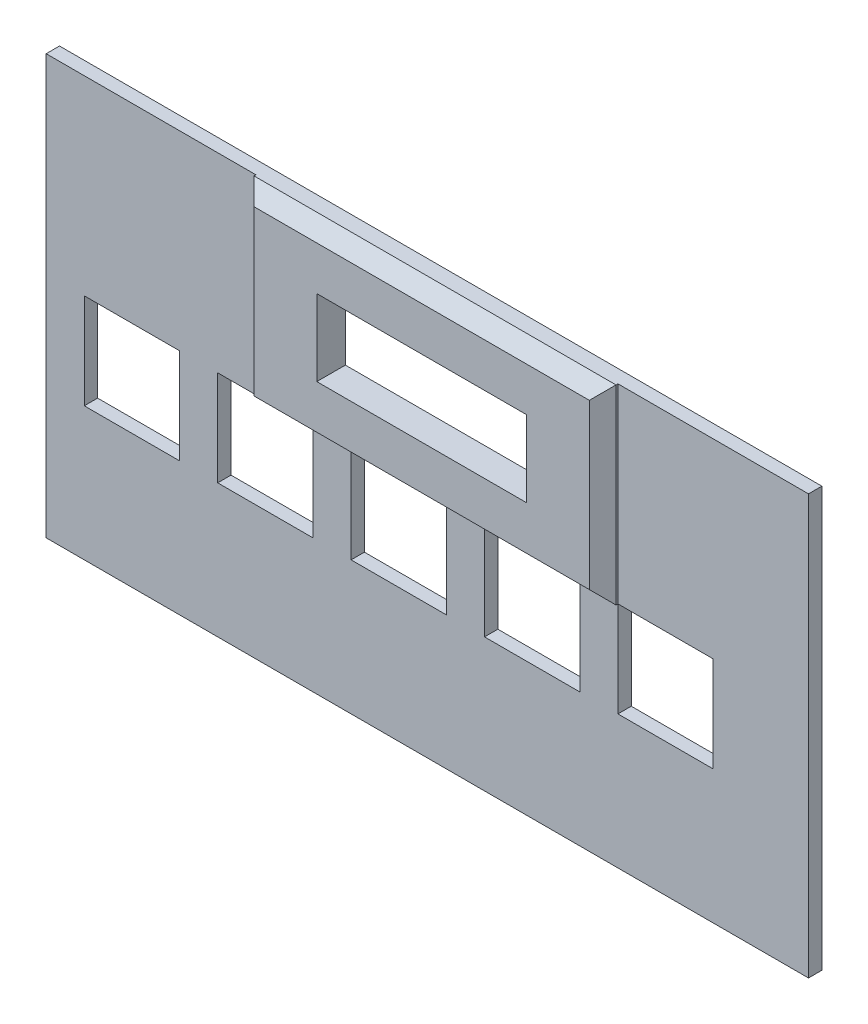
from build123d import *

# Parameters (mm, degrees)
ESQUISSE1_W        = 40
ESQUISSE1_H        = 22
ESQUISSE1_W_2      = 5
ESQUISSE1_H_2      = 5
ESQUISSE1_W_3      = 11
ESQUISSE1_H_3      = 4
BOSS_EXTRU_1_DEPTH = 0.35
ESQUISSE2_W        = 19
ESQUISSE2_H        = 10
ESQUISSE2_W_2      = 11
ESQUISSE2_H_2      = 4
BOSS_EXTRU_2_DEPTH = 0.8
CHANFREIN1_SIZE    = 0.7


with BuildPart() as part:
    # Esquisse1 → Boss.-Extru.1 (new, symmetric)
    with BuildSketch(Plane.XY):
        with Locations((-90.899490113, 111.768397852)):
            Rectangle(ESQUISSE1_W, ESQUISSE1_H)
        with Locations((-99.399490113, 110.268397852)):
            Rectangle(ESQUISSE1_W_2, ESQUISSE1_H_2, mode=Mode.SUBTRACT)
        with Locations((-106.399490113, 110.268397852)):
            Rectangle(ESQUISSE1_W_2, ESQUISSE1_H_2, mode=Mode.SUBTRACT)
        with Locations((-90.399490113, 117.768397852)):
            Rectangle(ESQUISSE1_W_3, ESQUISSE1_H_3, mode=Mode.SUBTRACT)
        with Locations((-92.399490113, 110.268397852)):
            Rectangle(ESQUISSE1_W_2, ESQUISSE1_H_2, mode=Mode.SUBTRACT)
        with Locations((-85.399490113, 110.268397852)):
            Rectangle(ESQUISSE1_W_2, ESQUISSE1_H_2, mode=Mode.SUBTRACT)
        with Locations((-78.399490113, 110.268397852)):
            Rectangle(ESQUISSE1_W_2, ESQUISSE1_H_2, mode=Mode.SUBTRACT)
    extrude(amount=BOSS_EXTRU_1_DEPTH, both=True)

    # Esquisse2 → Boss.-Extru.2 (add)
    with BuildSketch(Plane.XY.offset(0.35)):
        with Locations((-90.399490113, 117.768397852)):
            Rectangle(ESQUISSE2_W, ESQUISSE2_H)
        with Locations((-90.399490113, 117.768397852)):
            Rectangle(ESQUISSE2_W_2, ESQUISSE2_H_2, mode=Mode.SUBTRACT)
    extrude(amount=BOSS_EXTRU_2_DEPTH)

    # Chanfrein1
    chanfrein1_edges = [part.edges().sort_by_distance(p)[0] for p in [
        (-90.399490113, 122.768397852, 1.15),
        (-99.899490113, 117.768397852, 1.15),
        (-90.399490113, 112.768397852, 1.15),
        (-80.899490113, 117.768397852, 1.15),
    ]]
    chamfer(chanfrein1_edges, length=CHANFREIN1_SIZE)


solid = part.part
